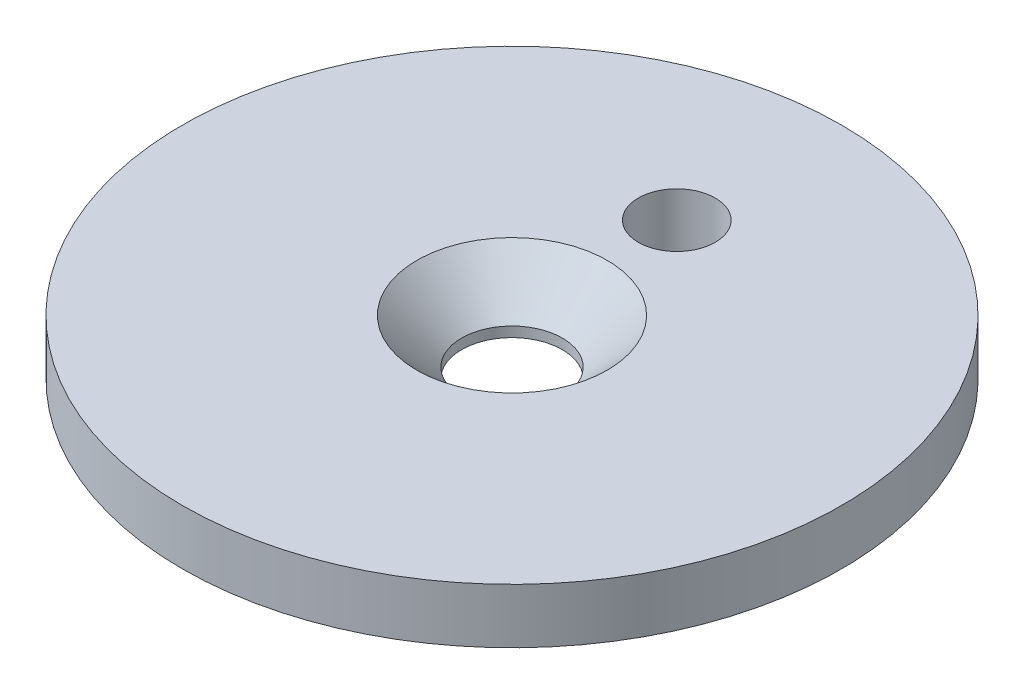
from build123d import *

# Parameters (mm, degrees)
SKETCH1_R         = 18
EXTRUDE1_DEPTH    = 3
M5_TAPPED_HOLE1_D = 4.2


with BuildPart() as part:
    # Sketch1 → Extrude1 (new body)
    with BuildSketch(Plane(origin=(0, 0, 0), x_dir=(1, 0, 0), z_dir=(0, 1, 0))):
        with Locations(Location((0, 0, 0), (0, 0, 270))):
            Circle(SKETCH1_R)
    extrude(amount=EXTRUDE1_DEPTH)

    # M5 Tapped Hole1 (through all)
    with Locations(Plane(origin=(0, 3, -9), x_dir=(0, 0, 1), z_dir=(0, 1, 0))):
        with Locations((0, 0)):
            Hole(M5_TAPPED_HOLE1_D / 2)

    # Sketch5 → CSK for M5 Countersunk Flat Head Screw1 (revolve, cut)
    with BuildSketch(Plane(origin=(0, 3, 0), x_dir=(0, 0, 1), z_dir=(1, 0, 0))):
        Polygon((0, 0), (0, 3), (2.75, 3), (2.75, 2.45), (5.2, 0), align=None)
    revolve(axis=Axis((0, 9.35, 0), (0, -1, 0)), mode=Mode.SUBTRACT)


solid = part.part
